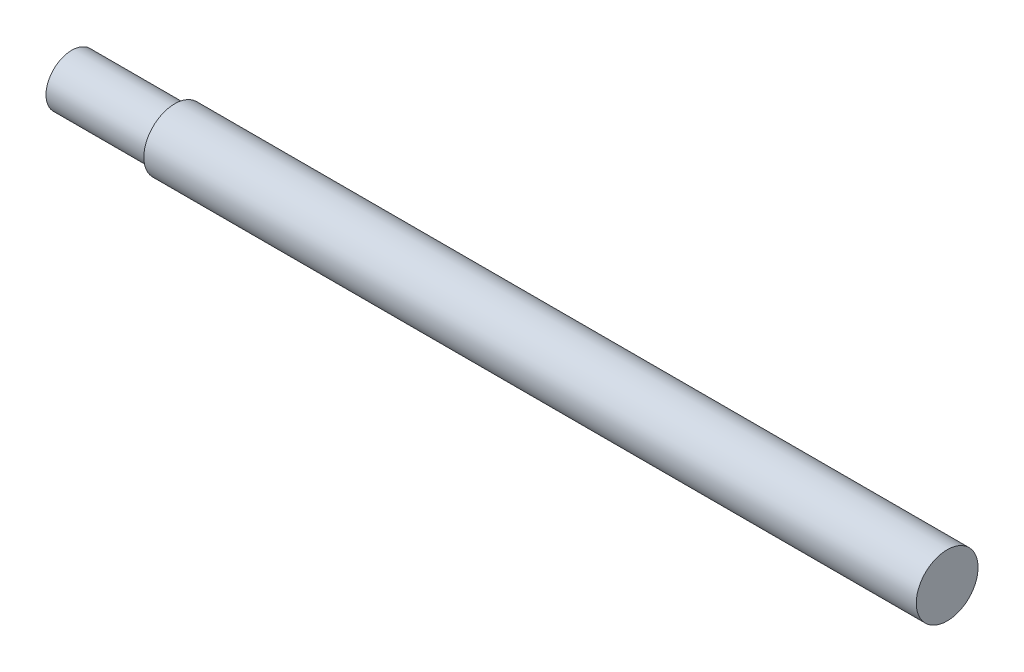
ISO-10303-21;
HEADER;
FILE_DESCRIPTION(('STEP AP214'),'2;1');
FILE_NAME('part.step','',(''),(''),'','','');
FILE_SCHEMA(('AUTOMOTIVE_DESIGN { 1 0 10303 214 1 1 1 1 }'));
ENDSEC;
DATA;
#1=APPLICATION_CONTEXT('core data for automotive mechanical design processes');
#2=APPLICATION_PROTOCOL_DEFINITION('international standard','automotive_design',2000,#1);
#3=PRODUCT_CONTEXT('',#1,'mechanical');
#4=PRODUCT('Part','Part','',(#3));
#5=PRODUCT_RELATED_PRODUCT_CATEGORY('part','',(#4));
#6=PRODUCT_DEFINITION_FORMATION('','',#4);
#7=PRODUCT_DEFINITION_CONTEXT('part definition',#1,'design');
#8=PRODUCT_DEFINITION('design','',#6,#7);
#9=PRODUCT_DEFINITION_SHAPE('','',#8);
#10=(LENGTH_UNIT() NAMED_UNIT(*) SI_UNIT(.MILLI.,.METRE.));
#11=(NAMED_UNIT(*) PLANE_ANGLE_UNIT() SI_UNIT($,.RADIAN.));
#12=(NAMED_UNIT(*) SI_UNIT($,.STERADIAN.) SOLID_ANGLE_UNIT());
#13=UNCERTAINTY_MEASURE_WITH_UNIT(LENGTH_MEASURE(1.E-05),#10,'distance_accuracy_value','');
#14=(GEOMETRIC_REPRESENTATION_CONTEXT(3) GLOBAL_UNCERTAINTY_ASSIGNED_CONTEXT((#13)) GLOBAL_UNIT_ASSIGNED_CONTEXT((#10,
#11,#12)) REPRESENTATION_CONTEXT('',''));
#15=CARTESIAN_POINT('',(0.,0.,0.));
#16=DIRECTION('',(0.,0.,1.));
#17=DIRECTION('',(1.,0.,0.));
#18=AXIS2_PLACEMENT_3D('',#15,#16,#17);
#19=CARTESIAN_POINT('',(-75.8302617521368,0.,0.));
#20=DIRECTION('',(1.,0.,0.));
#21=DIRECTION('',(0.,0.,-1.));
#22=AXIS2_PLACEMENT_3D('',#19,#20,#21);
#23=PLANE('',#22);
#24=CARTESIAN_POINT('',(-75.8302617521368,0.,0.));
#25=DIRECTION('',(-1.,0.,0.));
#26=DIRECTION('',(0.,0.,1.));
#27=AXIS2_PLACEMENT_3D('',#24,#25,#26);
#28=CIRCLE('',#27,5.);
#29=CARTESIAN_POINT('',(-75.8302617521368,0.,5.));
#30=VERTEX_POINT('',#29);
#31=EDGE_CURVE('E10',#30,#30,#28,.T.);
#32=ORIENTED_EDGE('',*,*,#31,.T.);
#33=EDGE_LOOP('',(#32));
#34=FACE_BOUND('',#33,.T.);
#35=ADVANCED_FACE('F31',(#34),#23,.F.);
#36=CARTESIAN_POINT('',(-81.6068503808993,0.,0.));
#37=DIRECTION('',(-1.,0.,0.));
#38=DIRECTION('',(0.,0.,1.));
#39=AXIS2_PLACEMENT_3D('',#36,#37,#38);
#40=CYLINDRICAL_SURFACE('',#39,5.);
#41=ORIENTED_EDGE('',*,*,#31,.F.);
#42=EDGE_LOOP('',(#41));
#43=FACE_BOUND('',#42,.T.);
#44=CARTESIAN_POINT('',(-55.8302617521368,0.,0.));
#45=DIRECTION('',(-1.,0.,0.));
#46=DIRECTION('',(0.,0.,1.));
#47=AXIS2_PLACEMENT_3D('',#44,#45,#46);
#48=CIRCLE('',#47,5.);
#49=CARTESIAN_POINT('',(-55.8302617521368,0.,5.));
#50=VERTEX_POINT('',#49);
#51=EDGE_CURVE('E37',#50,#50,#48,.T.);
#52=ORIENTED_EDGE('',*,*,#51,.T.);
#53=EDGE_LOOP('',(#52));
#54=FACE_BOUND('',#53,.T.);
#55=ADVANCED_FACE('F63',(#43,#54),#40,.T.);
#56=CARTESIAN_POINT('',(-55.8302617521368,5.,0.));
#57=DIRECTION('',(1.,0.,0.));
#58=DIRECTION('',(0.,0.,-1.));
#59=AXIS2_PLACEMENT_3D('',#56,#57,#58);
#60=PLANE('',#59);
#61=ORIENTED_EDGE('',*,*,#51,.F.);
#62=EDGE_LOOP('',(#61));
#63=FACE_BOUND('',#62,.T.);
#64=CARTESIAN_POINT('',(-55.8302617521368,0.,0.));
#65=DIRECTION('',(-1.,0.,0.));
#66=DIRECTION('',(0.,0.,1.));
#67=AXIS2_PLACEMENT_3D('',#64,#65,#66);
#68=CIRCLE('',#67,6.);
#69=CARTESIAN_POINT('',(-55.8302617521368,0.,6.));
#70=VERTEX_POINT('',#69);
#71=EDGE_CURVE('E41',#70,#70,#68,.T.);
#72=ORIENTED_EDGE('',*,*,#71,.T.);
#73=EDGE_LOOP('',(#72));
#74=FACE_BOUND('',#73,.T.);
#75=ADVANCED_FACE('F59',(#63,#74),#60,.F.);
#76=CARTESIAN_POINT('',(-81.6068503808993,0.,0.));
#77=DIRECTION('',(-1.,0.,0.));
#78=DIRECTION('',(0.,0.,1.));
#79=AXIS2_PLACEMENT_3D('',#76,#77,#78);
#80=CYLINDRICAL_SURFACE('',#79,6.);
#81=ORIENTED_EDGE('',*,*,#71,.F.);
#82=EDGE_LOOP('',(#81));
#83=FACE_BOUND('',#82,.T.);
#84=CARTESIAN_POINT('',(94.1697382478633,0.,0.));
#85=DIRECTION('',(-1.,0.,0.));
#86=DIRECTION('',(0.,0.,1.));
#87=AXIS2_PLACEMENT_3D('',#84,#85,#86);
#88=CIRCLE('',#87,6.);
#89=CARTESIAN_POINT('',(94.1697382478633,0.,6.));
#90=VERTEX_POINT('',#89);
#91=EDGE_CURVE('E45',#90,#90,#88,.T.);
#92=ORIENTED_EDGE('',*,*,#91,.T.);
#93=EDGE_LOOP('',(#92));
#94=FACE_BOUND('',#93,.T.);
#95=ADVANCED_FACE('F51',(#83,#94),#80,.T.);
#96=CARTESIAN_POINT('',(94.1697382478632,6.,0.));
#97=DIRECTION('',(-1.,0.,0.));
#98=DIRECTION('',(0.,0.,1.));
#99=AXIS2_PLACEMENT_3D('',#96,#97,#98);
#100=PLANE('',#99);
#101=ORIENTED_EDGE('',*,*,#91,.F.);
#102=EDGE_LOOP('',(#101));
#103=FACE_BOUND('',#102,.T.);
#104=ADVANCED_FACE('F53',(#103),#100,.F.);
#105=CLOSED_SHELL('',(#35,#55,#75,#95,#104));
#106=MANIFOLD_SOLID_BREP('B2',#105);
#107=ADVANCED_BREP_SHAPE_REPRESENTATION('',(#18,#106),#14);
#108=SHAPE_DEFINITION_REPRESENTATION(#9,#107);
ENDSEC;
END-ISO-10303-21;
